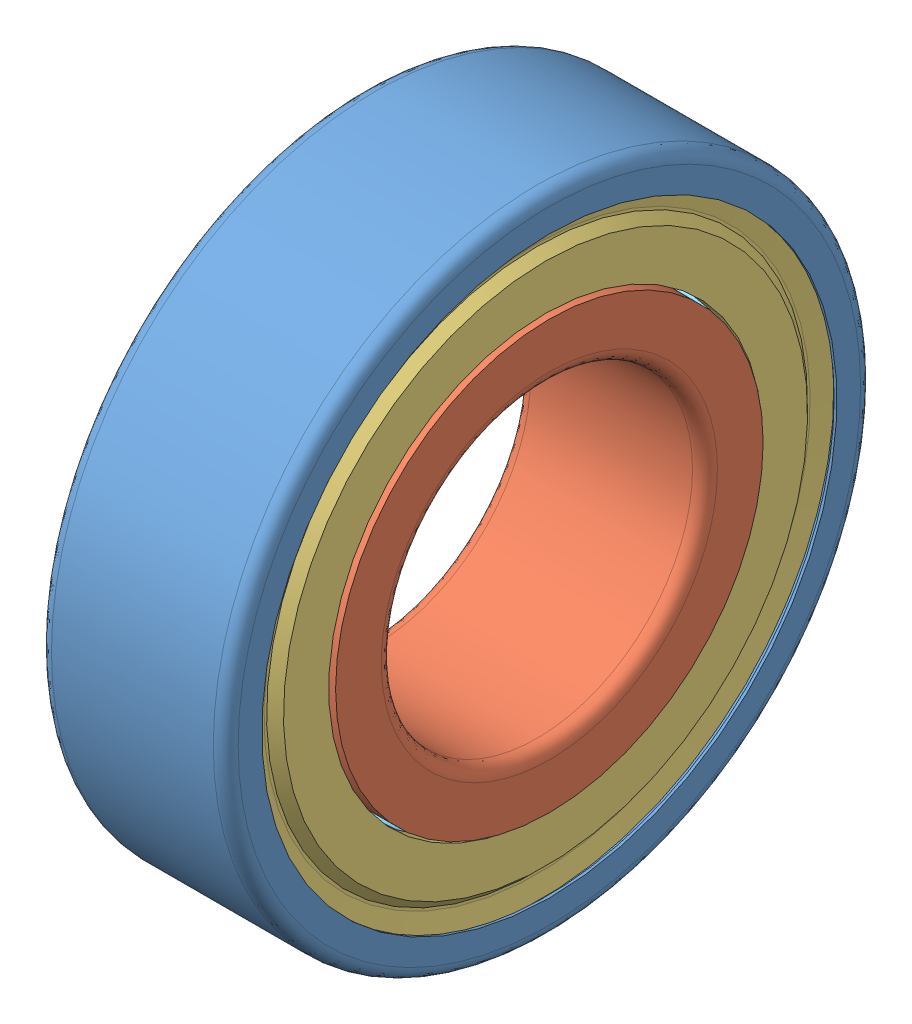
SolidWorks assembly skf_bearing_6205-2z_2.SLDASM, configuration Default (file format 8000). Lengths in mm.
Overall size (15 52 52).
5 component instances, 5 part files, 0 mates.
Components (placement in the parent):
- skf_bearing_6205-2z_2_01-1: skf_bearing_6205-2z_2_01.SLDPRT [Default] at origin size (15 52 52)
- skf_bearing_6205-2z_2_02-1: skf_bearing_6205-2z_2_02.SLDPRT [Default] at origin size (15 34.35 34.35)
- skf_bearing_6205-2z_2_03-1: skf_bearing_6205-2z_2_03.SLDPRT [Default] at origin size (1.02 47.11 47.11)
- skf_bearing_6205-2z_2_04-1: skf_bearing_6205-2z_2_04.SLDPRT [Default] at origin size (1.02 47.11 47.11)
- skf_bearing_6205-2z_2_05-1: skf_bearing_6205-2z_2_05.SLDPRT [Default] at origin size (7.94 45.8 46.38)
